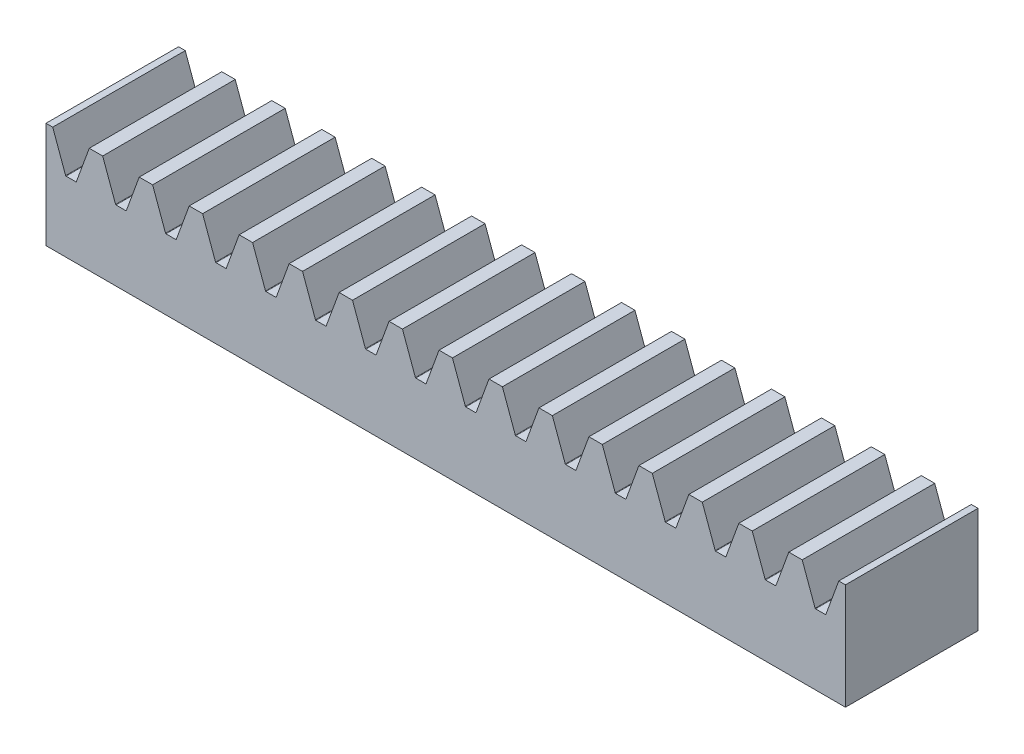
from build123d import *

# Parameters (mm, degrees)
SKETCH_1_W                     = 18.849555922
SKETCH_1_H                     = 40
EXTRUDE_1_DEPTH                = 50
CUT_EXTRUDE_1_DEPTH            = 67.748076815
FILLET_1_R                     = 0.2
PATTERN_LINEAR_3_COUNT         = 16
PATTERN_LINEAR_3_PITCH         = 18.849555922
FILLET_1_OF_PATTERN_LINEAR_3_R = 0.2


with BuildPart() as part:
    # Sketch 1 → Extrude 1 (new body)
    with BuildSketch(Plane.XY):
        with Locations((9.424777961, 20)):
            Rectangle(SKETCH_1_W, SKETCH_1_H)
    extrude_1 = extrude(amount=-EXTRUDE_1_DEPTH)

    # Sketch 2 → Cut-Extrude 1 (cut, through all)
    with BuildSketch(Plane.XY):
        Polygon((2.528567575, 40), (7.442165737, 26.5), (11.407390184, 26.5), (16.320988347, 40), align=None)
    cut_extrude_1 = extrude(amount=-CUT_EXTRUDE_1_DEPTH, mode=Mode.SUBTRACT)

    # Fillet 1
    fillet_1_edges = [part.edges().sort_by_distance(p)[0] for p in [
        (11.407390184, 26.5, -25),
        (7.442165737, 26.5, -25),
    ]]
    fillet(fillet_1_edges, radius=FILLET_1_R)

    # Pattern Linear 3: Extrude 1, Cut-Extrude 1 ×16
    with Locations(*[(i * PATTERN_LINEAR_3_PITCH, 0, 0) for i in range(1, PATTERN_LINEAR_3_COUNT)]):
        add(extrude_1)
        add(cut_extrude_1, mode=Mode.SUBTRACT)

    # Fillet 1 of Pattern Linear 3
    fillet_1_of_pattern_linear_3_edges = [part.edges().sort_by_distance(p)[0] for p in [
        (30.256946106, 26.5, -25),
        (26.291721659, 26.5, -25),
        (49.106502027, 26.5, -25),
        (45.14127758, 26.5, -25),
        (67.956057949, 26.5, -25),
        (63.990833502, 26.5, -25),
        (86.80561387, 26.5, -25),
        (82.840389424, 26.5, -25),
        (105.655169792, 26.5, -25),
        (101.689945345, 26.5, -25),
        (124.504725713, 26.5, -25),
        (120.539501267, 26.5, -25),
        (143.354281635, 26.5, -25),
        (139.389057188, 26.5, -25),
        (162.203837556, 26.5, -25),
        (158.23861311, 26.5, -25),
        (181.053393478, 26.5, -25),
        (177.088169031, 26.5, -25),
        (199.9029494, 26.5, -25),
        (195.937724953, 26.5, -25),
        (218.752505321, 26.5, -25),
        (214.787280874, 26.5, -25),
        (237.602061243, 26.5, -25),
        (233.636836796, 26.5, -25),
        (256.451617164, 26.5, -25),
        (252.486392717, 26.5, -25),
        (275.301173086, 26.5, -25),
        (271.335948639, 26.5, -25),
        (294.150729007, 26.5, -25),
        (290.18550456, 26.5, -25),
    ]]
    fillet(fillet_1_of_pattern_linear_3_edges, radius=FILLET_1_OF_PATTERN_LINEAR_3_R)


solid = part.part
